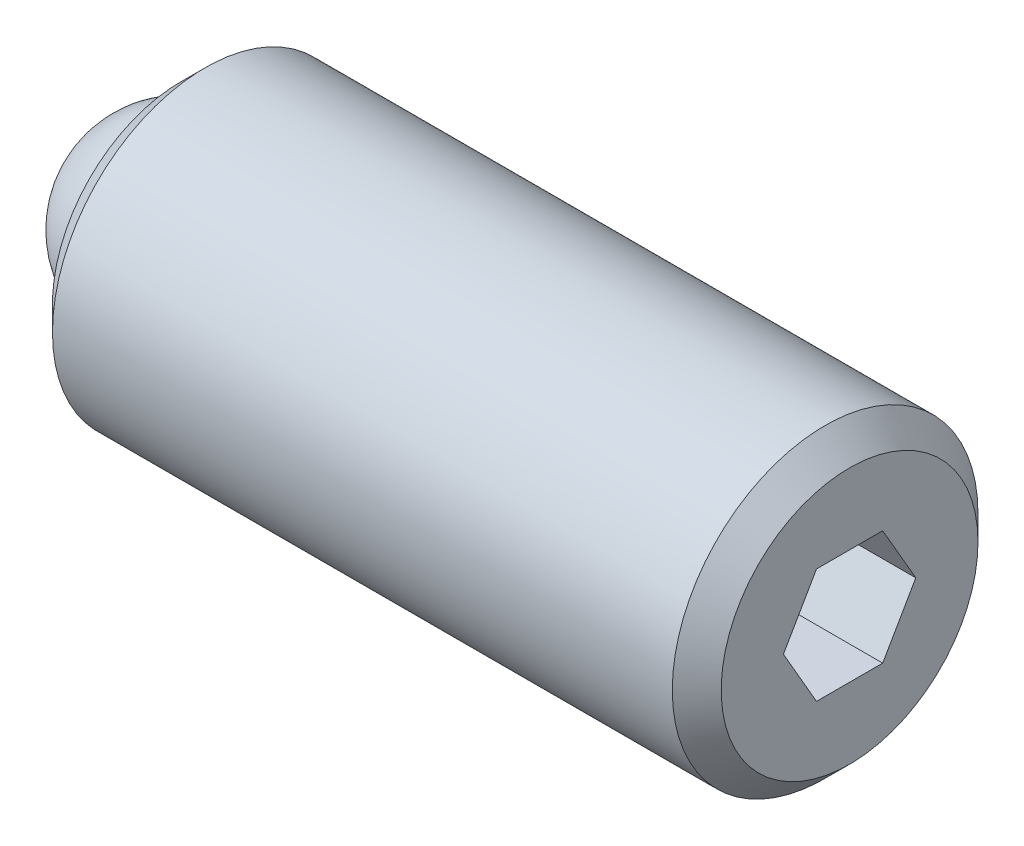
from build123d import *

# Parameters (mm, degrees)
SKETCH2_R           = 3.175
BOSS_EXTRUDE1_DEPTH = 13.890625
CHAMFER1_SIZE       = 0.508
CHAMFER2_SIZE       = 0.508
CUT_EXTRUDE2_DEPTH  = 2.286
SKETCH3_R           = 1.9812
CUT_EXTRUDE3_DEPTH  = 1.984375


with BuildPart() as part:
    # Sketch2 → Boss-Extrude1 (new body)
    with BuildSketch(Plane(origin=(0, 0, 0), x_dir=(0, 0, -1), z_dir=(1, 0, 0))):
        Circle(SKETCH2_R)
    extrude(amount=BOSS_EXTRUDE1_DEPTH)

    # Chamfer1
    chamfer1_edges = [part.edges().sort_by_distance(p)[0] for p in [
        (0, 0, 3.175),
    ]]
    chamfer(chamfer1_edges, length=CHAMFER1_SIZE)

    # Chamfer2
    chamfer2_edges = [part.edges().sort_by_distance(p)[0] for p in [
        (13.890625, 0, 3.175),
    ]]
    chamfer(chamfer2_edges, length=CHAMFER2_SIZE)

    # Sketch4 → Cut-Extrude2 (cut)
    with BuildSketch(Plane(origin=(13.890625, 0, 0), x_dir=(0, 0, -1), z_dir=(1, 0, 0))):
        Polygon((1.374815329, 0), (0.687407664, 1.190625), (-0.687407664, 1.190625), (-1.374815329, 0), (-0.687407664, -1.190625), (0.687407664, -1.190625), align=None)
    extrude(amount=-CUT_EXTRUDE2_DEPTH, mode=Mode.SUBTRACT)

    # Sketch3 → Cut-Extrude3 (cut)
    with BuildSketch(Plane.ZY):
        Circle(SKETCH3_R)
    extrude(amount=-CUT_EXTRUDE3_DEPTH, mode=Mode.SUBTRACT)


with BuildPart() as body_2:
    # Sketch5 → Revolve1 (revolve)
    with BuildSketch(Plane.ZY):
        with BuildLine():
            Line((0, 0), (0, -1.984375))
            ThreePointArc((0, -1.984375), (-1.984375, 0), (0, 1.984375))
            Line((0, 1.984375), (0, 0))
        make_face()
    revolve(axis=Axis((0, 0, 0), (0, 1, 0)))


solid = Compound([part.part, body_2.part])
